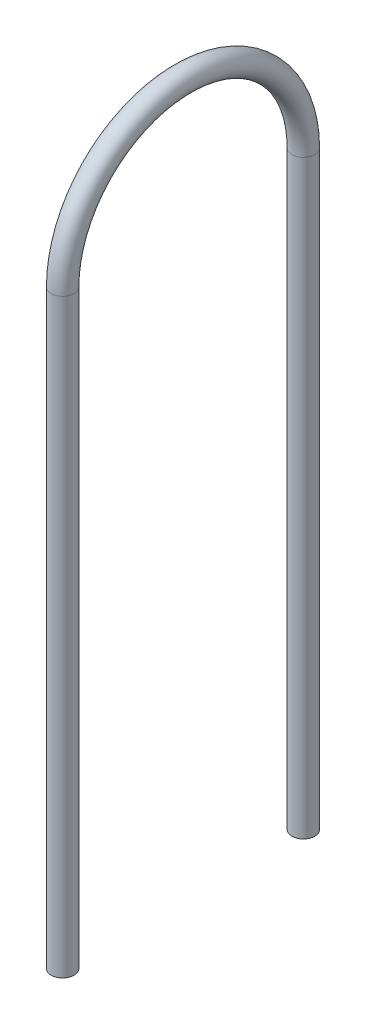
from build123d import *

# Parameters (mm, degrees)
SKETCH2_R = 2


with BuildPart() as part:
    # Sweep1: sweep along a path in Sketch1
    with BuildLine(Plane(origin=(0, 0, 0), x_dir=(0, 0, -1), z_dir=(1, 0, 0))) as sweep1_path:
        Line((-21, 0), (-21, 103))
        ThreePointArc((-21, 103), (0, 124), (21, 103))
        Line((21, 103), (21, 0))
    # Sketch2 → Sweep1 (sweep)
    with BuildSketch(Plane(origin=(0, 0, 0), x_dir=(1, 0, 0), z_dir=(0, 1, 0))):
        with Locations((0, -21)):
            Circle(SKETCH2_R)
    sweep(path=sweep1_path.line)


solid = part.part
